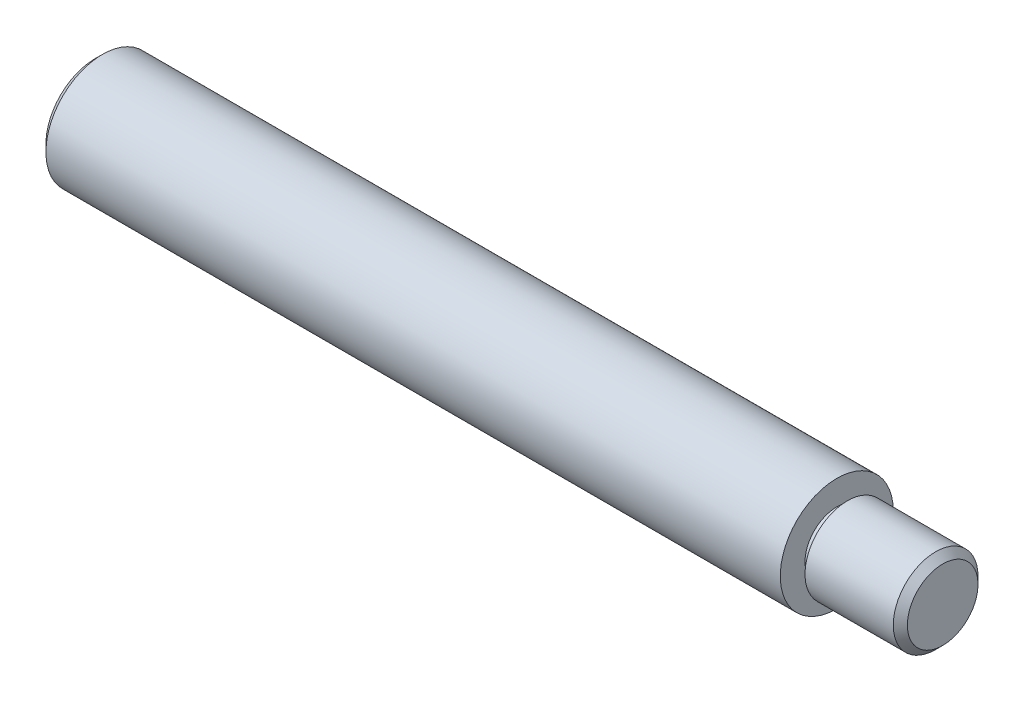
ISO-10303-21;
HEADER;
FILE_DESCRIPTION(('STEP AP214'),'2;1');
FILE_NAME('part.step','',(''),(''),'','','');
FILE_SCHEMA(('AUTOMOTIVE_DESIGN { 1 0 10303 214 1 1 1 1 }'));
ENDSEC;
DATA;
#1=APPLICATION_CONTEXT('core data for automotive mechanical design processes');
#2=APPLICATION_PROTOCOL_DEFINITION('international standard','automotive_design',2000,#1);
#3=PRODUCT_CONTEXT('',#1,'mechanical');
#4=PRODUCT('Part','Part','',(#3));
#5=PRODUCT_RELATED_PRODUCT_CATEGORY('part','',(#4));
#6=PRODUCT_DEFINITION_FORMATION('','',#4);
#7=PRODUCT_DEFINITION_CONTEXT('part definition',#1,'design');
#8=PRODUCT_DEFINITION('design','',#6,#7);
#9=PRODUCT_DEFINITION_SHAPE('','',#8);
#10=(LENGTH_UNIT() NAMED_UNIT(*) SI_UNIT(.MILLI.,.METRE.));
#11=(NAMED_UNIT(*) PLANE_ANGLE_UNIT() SI_UNIT($,.RADIAN.));
#12=(NAMED_UNIT(*) SI_UNIT($,.STERADIAN.) SOLID_ANGLE_UNIT());
#13=UNCERTAINTY_MEASURE_WITH_UNIT(LENGTH_MEASURE(1.E-05),#10,'distance_accuracy_value','');
#14=(GEOMETRIC_REPRESENTATION_CONTEXT(3) GLOBAL_UNCERTAINTY_ASSIGNED_CONTEXT((#13)) GLOBAL_UNIT_ASSIGNED_CONTEXT((#10,
#11,#12)) REPRESENTATION_CONTEXT('',''));
#15=CARTESIAN_POINT('',(0.,0.,0.));
#16=DIRECTION('',(0.,0.,1.));
#17=DIRECTION('',(1.,0.,0.));
#18=AXIS2_PLACEMENT_3D('',#15,#16,#17);
#19=CARTESIAN_POINT('',(120.,2.5,0.));
#20=DIRECTION('',(1.,0.,0.));
#21=DIRECTION('',(0.,0.,-1.));
#22=AXIS2_PLACEMENT_3D('',#19,#20,#21);
#23=PLANE('',#22);
#24=CARTESIAN_POINT('',(120.000000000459,0.,0.));
#25=DIRECTION('',(-1.,0.,0.));
#26=DIRECTION('',(0.,0.,1.));
#27=AXIS2_PLACEMENT_3D('',#24,#25,#26);
#28=CIRCLE('',#27,5.00000000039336);
#29=CARTESIAN_POINT('',(120.000000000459,0.,5.00000000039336));
#30=VERTEX_POINT('',#29);
#31=EDGE_CURVE('E20',#30,#30,#28,.T.);
#32=ORIENTED_EDGE('',*,*,#31,.F.);
#33=EDGE_LOOP('',(#32));
#34=FACE_BOUND('',#33,.T.);
#35=ADVANCED_FACE('F17',(#34),#23,.T.);
#36=CARTESIAN_POINT('',(118.999999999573,0.,0.));
#37=DIRECTION('',(-1.,0.,0.));
#38=DIRECTION('',(0.,0.,1.));
#39=AXIS2_PLACEMENT_3D('',#36,#37,#38);
#40=CONICAL_SURFACE('',#39,5.99999999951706,0.785398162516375);
#41=CARTESIAN_POINT('',(119.,0.,0.));
#42=DIRECTION('',(1.,0.,0.));
#43=DIRECTION('',(0.,0.,-1.));
#44=AXIS2_PLACEMENT_3D('',#41,#42,#43);
#45=CIRCLE('',#44,6.);
#46=CARTESIAN_POINT('',(119.,0.,-6.));
#47=VERTEX_POINT('',#46);
#48=EDGE_CURVE('E45',#47,#47,#45,.F.);
#49=ORIENTED_EDGE('',*,*,#48,.F.);
#50=EDGE_LOOP('',(#49));
#51=FACE_BOUND('',#50,.T.);
#52=ORIENTED_EDGE('',*,*,#31,.T.);
#53=EDGE_LOOP('',(#52));
#54=FACE_BOUND('',#53,.T.);
#55=ADVANCED_FACE('F137',(#51,#54),#40,.T.);
#56=CARTESIAN_POINT('',(112.75,0.,0.));
#57=DIRECTION('',(1.,0.,0.));
#58=DIRECTION('',(0.,0.,-1.));
#59=AXIS2_PLACEMENT_3D('',#56,#57,#58);
#60=CYLINDRICAL_SURFACE('',#59,6.);
#61=CARTESIAN_POINT('',(106.5,0.,0.));
#62=DIRECTION('',(1.,0.,0.));
#63=DIRECTION('',(0.,0.,-1.));
#64=AXIS2_PLACEMENT_3D('',#61,#62,#63);
#65=CIRCLE('',#64,6.);
#66=CARTESIAN_POINT('',(106.5,0.,-6.));
#67=VERTEX_POINT('',#66);
#68=EDGE_CURVE('E39',#67,#67,#65,.F.);
#69=ORIENTED_EDGE('',*,*,#68,.F.);
#70=EDGE_LOOP('',(#69));
#71=FACE_BOUND('',#70,.T.);
#72=ORIENTED_EDGE('',*,*,#48,.T.);
#73=EDGE_LOOP('',(#72));
#74=FACE_BOUND('',#73,.T.);
#75=ADVANCED_FACE('F32',(#71,#74),#60,.T.);
#76=CARTESIAN_POINT('',(19.9999999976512,0.,0.));
#77=DIRECTION('',(-1.,0.,0.));
#78=DIRECTION('',(0.,0.,1.));
#79=AXIS2_PLACEMENT_3D('',#76,#77,#78);
#80=CONICAL_SURFACE('',#79,4.18799999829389,1.0297442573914);
#81=CARTESIAN_POINT('',(22.5164042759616,0.,-2.8421709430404E-10));
#82=VERTEX_POINT('',#81);
#83=VERTEX_LOOP('',#82);
#84=FACE_BOUND('',#83,.T.);
#85=CARTESIAN_POINT('',(20.,0.,0.));
#86=DIRECTION('',(-1.,0.,0.));
#87=DIRECTION('',(0.,0.,1.));
#88=AXIS2_PLACEMENT_3D('',#85,#86,#87);
#89=CIRCLE('',#88,4.188);
#90=CARTESIAN_POINT('',(20.,0.,4.188));
#91=VERTEX_POINT('',#90);
#92=EDGE_CURVE('E36',#91,#91,#89,.T.);
#93=ORIENTED_EDGE('',*,*,#92,.T.);
#94=EDGE_LOOP('',(#93));
#95=FACE_BOUND('',#94,.T.);
#96=ADVANCED_FACE('F28',(#84,#95),#80,.F.);
#97=CARTESIAN_POINT('',(106.5,5.25,0.));
#98=DIRECTION('',(-1.,0.,0.));
#99=DIRECTION('',(0.,0.,1.));
#100=AXIS2_PLACEMENT_3D('',#97,#98,#99);
#101=PLANE('',#100);
#102=CARTESIAN_POINT('',(106.5,0.,0.));
#103=DIRECTION('',(1.,0.,0.));
#104=DIRECTION('',(0.,0.,-1.));
#105=AXIS2_PLACEMENT_3D('',#102,#103,#104);
#106=CIRCLE('',#105,4.5);
#107=CARTESIAN_POINT('',(106.5,0.,-4.5));
#108=VERTEX_POINT('',#107);
#109=EDGE_CURVE('E38',#108,#108,#106,.F.);
#110=ORIENTED_EDGE('',*,*,#109,.F.);
#111=EDGE_LOOP('',(#110));
#112=FACE_BOUND('',#111,.T.);
#113=ORIENTED_EDGE('',*,*,#68,.T.);
#114=EDGE_LOOP('',(#113));
#115=FACE_BOUND('',#114,.T.);
#116=ADVANCED_FACE('F31',(#112,#115),#101,.T.);
#117=CARTESIAN_POINT('',(10.,0.,0.));
#118=DIRECTION('',(-1.,0.,0.));
#119=DIRECTION('',(0.,0.,1.));
#120=AXIS2_PLACEMENT_3D('',#117,#118,#119);
#121=CYLINDRICAL_SURFACE('',#120,4.188);
#122=ORIENTED_EDGE('',*,*,#92,.F.);
#123=EDGE_LOOP('',(#122));
#124=FACE_BOUND('',#123,.T.);
#125=CARTESIAN_POINT('',(0.,0.,0.));
#126=DIRECTION('',(-1.,0.,0.));
#127=DIRECTION('',(0.,0.,1.));
#128=AXIS2_PLACEMENT_3D('',#125,#126,#127);
#129=CIRCLE('',#128,4.188);
#130=CARTESIAN_POINT('',(0.,0.,4.188));
#131=VERTEX_POINT('',#130);
#132=EDGE_CURVE('E42',#131,#131,#129,.F.);
#133=ORIENTED_EDGE('',*,*,#132,.F.);
#134=EDGE_LOOP('',(#133));
#135=FACE_BOUND('',#134,.T.);
#136=ADVANCED_FACE('F69',(#124,#135),#121,.F.);
#137=CARTESIAN_POINT('',(105.75,0.,0.));
#138=DIRECTION('',(1.,0.,0.));
#139=DIRECTION('',(0.,0.,-1.));
#140=AXIS2_PLACEMENT_3D('',#137,#138,#139);
#141=CYLINDRICAL_SURFACE('',#140,4.5);
#142=CARTESIAN_POINT('',(105.,0.,0.));
#143=DIRECTION('',(1.,0.,0.));
#144=DIRECTION('',(0.,0.,-1.));
#145=AXIS2_PLACEMENT_3D('',#142,#143,#144);
#146=CIRCLE('',#145,4.5);
#147=CARTESIAN_POINT('',(105.,0.,-4.5));
#148=VERTEX_POINT('',#147);
#149=EDGE_CURVE('E60',#148,#148,#146,.F.);
#150=ORIENTED_EDGE('',*,*,#149,.F.);
#151=EDGE_LOOP('',(#150));
#152=FACE_BOUND('',#151,.T.);
#153=ORIENTED_EDGE('',*,*,#109,.T.);
#154=EDGE_LOOP('',(#153));
#155=FACE_BOUND('',#154,.T.);
#156=ADVANCED_FACE('F71',(#152,#155),#141,.T.);
#157=CARTESIAN_POINT('',(0.,3.5,0.));
#158=DIRECTION('',(-1.,0.,0.));
#159=DIRECTION('',(0.,0.,1.));
#160=AXIS2_PLACEMENT_3D('',#157,#158,#159);
#161=PLANE('',#160);
#162=ORIENTED_EDGE('',*,*,#132,.T.);
#163=EDGE_LOOP('',(#162));
#164=FACE_BOUND('',#163,.T.);
#165=CARTESIAN_POINT('',(-4.48720487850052E-10,0.,0.));
#166=DIRECTION('',(1.,0.,0.));
#167=DIRECTION('',(0.,0.,-1.));
#168=AXIS2_PLACEMENT_3D('',#165,#166,#167);
#169=CIRCLE('',#168,7.00000000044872);
#170=CARTESIAN_POINT('',(-4.48720487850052E-10,0.,-7.00000000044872));
#171=VERTEX_POINT('',#170);
#172=EDGE_CURVE('E57',#171,#171,#169,.T.);
#173=ORIENTED_EDGE('',*,*,#172,.F.);
#174=EDGE_LOOP('',(#173));
#175=FACE_BOUND('',#174,.T.);
#176=ADVANCED_FACE('F66',(#164,#175),#161,.T.);
#177=CARTESIAN_POINT('',(105.,6.25,0.));
#178=DIRECTION('',(1.,0.,0.));
#179=DIRECTION('',(0.,0.,-1.));
#180=AXIS2_PLACEMENT_3D('',#177,#178,#179);
#181=PLANE('',#180);
#182=ORIENTED_EDGE('',*,*,#149,.T.);
#183=EDGE_LOOP('',(#182));
#184=FACE_BOUND('',#183,.T.);
#185=CARTESIAN_POINT('',(105.,0.,0.));
#186=DIRECTION('',(1.,0.,0.));
#187=DIRECTION('',(0.,0.,-1.));
#188=AXIS2_PLACEMENT_3D('',#185,#186,#187);
#189=CIRCLE('',#188,8.);
#190=CARTESIAN_POINT('',(105.,0.,-8.));
#191=VERTEX_POINT('',#190);
#192=EDGE_CURVE('E24',#191,#191,#189,.F.);
#193=ORIENTED_EDGE('',*,*,#192,.F.);
#194=EDGE_LOOP('',(#193));
#195=FACE_BOUND('',#194,.T.);
#196=ADVANCED_FACE('F90',(#184,#195),#181,.T.);
#197=CARTESIAN_POINT('',(1.00000000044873,0.,0.));
#198=DIRECTION('',(1.,0.,0.));
#199=DIRECTION('',(0.,0.,-1.));
#200=AXIS2_PLACEMENT_3D('',#197,#198,#199);
#201=CONICAL_SURFACE('',#200,7.99999999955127,0.7853981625);
#202=ORIENTED_EDGE('',*,*,#172,.T.);
#203=EDGE_LOOP('',(#202));
#204=FACE_BOUND('',#203,.T.);
#205=CARTESIAN_POINT('',(1.,0.,0.));
#206=DIRECTION('',(1.,0.,0.));
#207=DIRECTION('',(0.,0.,-1.));
#208=AXIS2_PLACEMENT_3D('',#205,#206,#207);
#209=CIRCLE('',#208,8.);
#210=CARTESIAN_POINT('',(1.,0.,-8.));
#211=VERTEX_POINT('',#210);
#212=EDGE_CURVE('E11',#211,#211,#209,.T.);
#213=ORIENTED_EDGE('',*,*,#212,.F.);
#214=EDGE_LOOP('',(#213));
#215=FACE_BOUND('',#214,.T.);
#216=ADVANCED_FACE('F84',(#204,#215),#201,.T.);
#217=CARTESIAN_POINT('',(53.,0.,0.));
#218=DIRECTION('',(1.,0.,0.));
#219=DIRECTION('',(0.,0.,-1.));
#220=AXIS2_PLACEMENT_3D('',#217,#218,#219);
#221=CYLINDRICAL_SURFACE('',#220,8.);
#222=ORIENTED_EDGE('',*,*,#212,.T.);
#223=EDGE_LOOP('',(#222));
#224=FACE_BOUND('',#223,.T.);
#225=ORIENTED_EDGE('',*,*,#192,.T.);
#226=EDGE_LOOP('',(#225));
#227=FACE_BOUND('',#226,.T.);
#228=ADVANCED_FACE('F82',(#224,#227),#221,.T.);
#229=CLOSED_SHELL('',(#35,#55,#75,#96,#116,#136,#156,#176,#196,#216,#228));
#230=MANIFOLD_SOLID_BREP('B1',#229);
#231=ADVANCED_BREP_SHAPE_REPRESENTATION('',(#18,#230),#14);
#232=SHAPE_DEFINITION_REPRESENTATION(#9,#231);
ENDSEC;
END-ISO-10303-21;
